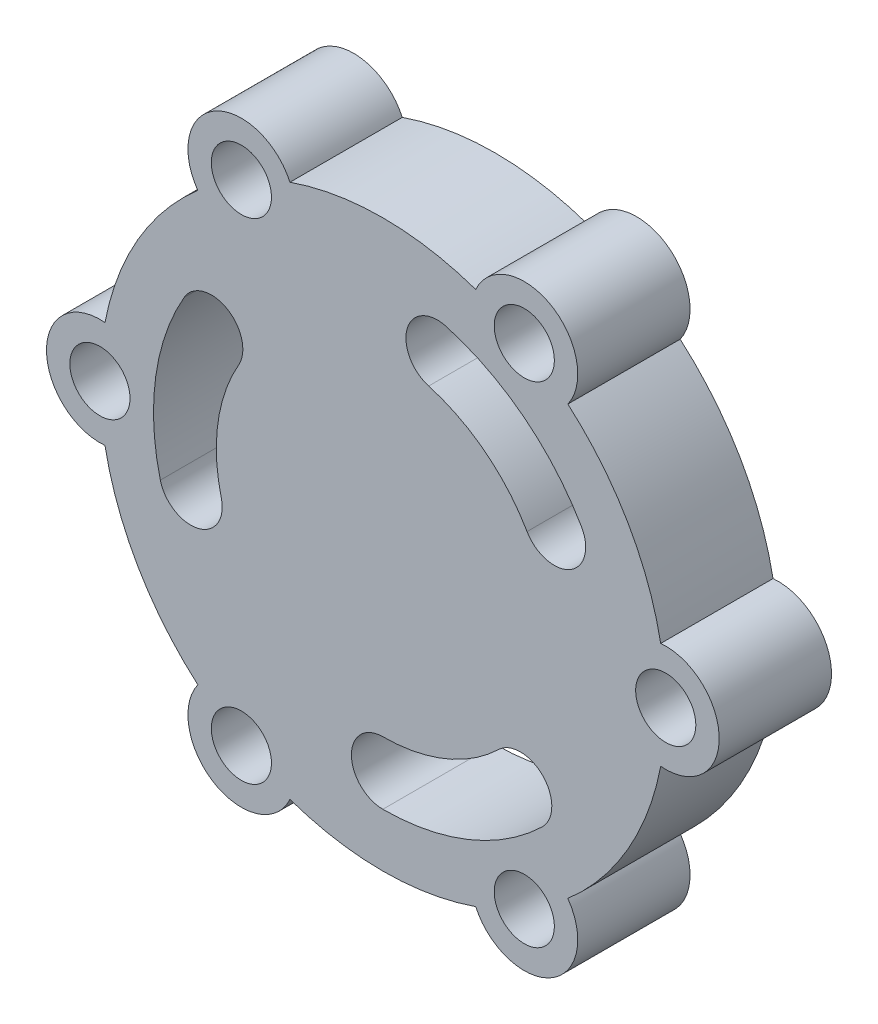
ISO-10303-21;
HEADER;
FILE_DESCRIPTION(('STEP AP214'),'2;1');
FILE_NAME('part.step','',(''),(''),'','','');
FILE_SCHEMA(('AUTOMOTIVE_DESIGN { 1 0 10303 214 1 1 1 1 }'));
ENDSEC;
DATA;
#1=APPLICATION_CONTEXT('core data for automotive mechanical design processes');
#2=APPLICATION_PROTOCOL_DEFINITION('international standard','automotive_design',2000,#1);
#3=PRODUCT_CONTEXT('',#1,'mechanical');
#4=PRODUCT('Part','Part','',(#3));
#5=PRODUCT_RELATED_PRODUCT_CATEGORY('part','',(#4));
#6=PRODUCT_DEFINITION_FORMATION('','',#4);
#7=PRODUCT_DEFINITION_CONTEXT('part definition',#1,'design');
#8=PRODUCT_DEFINITION('design','',#6,#7);
#9=PRODUCT_DEFINITION_SHAPE('','',#8);
#10=(LENGTH_UNIT() NAMED_UNIT(*) SI_UNIT(.MILLI.,.METRE.));
#11=(NAMED_UNIT(*) PLANE_ANGLE_UNIT() SI_UNIT($,.RADIAN.));
#12=(NAMED_UNIT(*) SI_UNIT($,.STERADIAN.) SOLID_ANGLE_UNIT());
#13=UNCERTAINTY_MEASURE_WITH_UNIT(LENGTH_MEASURE(1.E-05),#10,'distance_accuracy_value','');
#14=(GEOMETRIC_REPRESENTATION_CONTEXT(3) GLOBAL_UNCERTAINTY_ASSIGNED_CONTEXT((#13)) GLOBAL_UNIT_ASSIGNED_CONTEXT((#10,
#11,#12)) REPRESENTATION_CONTEXT('',''));
#15=CARTESIAN_POINT('',(0.,0.,0.));
#16=DIRECTION('',(0.,0.,1.));
#17=DIRECTION('',(1.,0.,0.));
#18=AXIS2_PLACEMENT_3D('',#15,#16,#17);
#19=CARTESIAN_POINT('',(25.1872205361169,0.,20.));
#20=DIRECTION('',(0.,0.,1.));
#21=DIRECTION('',(1.,0.,0.));
#22=AXIS2_PLACEMENT_3D('',#19,#20,#21);
#23=PLANE('',#22);
#24=CARTESIAN_POINT('',(-25.1872205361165,43.6255456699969,20.));
#25=DIRECTION('',(0.,0.,1.));
#26=DIRECTION('',(1.,0.,0.));
#27=AXIS2_PLACEMENT_3D('',#24,#25,#26);
#28=CIRCLE('',#27,5.35446502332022);
#29=CARTESIAN_POINT('',(-19.8327555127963,43.6255456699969,20.));
#30=VERTEX_POINT('',#29);
#31=EDGE_CURVE('E737',#30,#30,#28,.T.);
#32=ORIENTED_EDGE('',*,*,#31,.F.);
#33=EDGE_LOOP('',(#32));
#34=FACE_BOUND('',#33,.T.);
#35=CARTESIAN_POINT('',(-25.1872205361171,-43.6255456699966,20.));
#36=DIRECTION('',(0.,0.,1.));
#37=DIRECTION('',(1.,0.,0.));
#38=AXIS2_PLACEMENT_3D('',#35,#36,#37);
#39=CIRCLE('',#38,5.35446502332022);
#40=CARTESIAN_POINT('',(-19.8327555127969,-43.6255456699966,20.));
#41=VERTEX_POINT('',#40);
#42=EDGE_CURVE('E749',#41,#41,#39,.T.);
#43=ORIENTED_EDGE('',*,*,#42,.F.);
#44=EDGE_LOOP('',(#43));
#45=FACE_BOUND('',#44,.T.);
#46=CARTESIAN_POINT('',(50.3744410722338,0.,20.));
#47=DIRECTION('',(0.,0.,1.));
#48=DIRECTION('',(1.,0.,0.));
#49=AXIS2_PLACEMENT_3D('',#46,#47,#48);
#50=CIRCLE('',#49,5.35446502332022);
#51=CARTESIAN_POINT('',(55.728906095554,0.,20.));
#52=VERTEX_POINT('',#51);
#53=EDGE_CURVE('E223',#52,#52,#50,.T.);
#54=ORIENTED_EDGE('',*,*,#53,.F.);
#55=EDGE_LOOP('',(#54));
#56=FACE_BOUND('',#55,.T.);
#57=CARTESIAN_POINT('',(50.3744410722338,0.,20.));
#58=DIRECTION('',(0.,0.,1.));
#59=DIRECTION('',(1.,0.,0.));
#60=AXIS2_PLACEMENT_3D('',#57,#58,#59);
#61=CIRCLE('',#60,9.51422655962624);
#62=CARTESIAN_POINT('',(49.4759645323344,-9.47170770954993,20.));
#63=VERTEX_POINT('',#62);
#64=CARTESIAN_POINT('',(49.4759645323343,9.47170770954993,20.));
#65=VERTEX_POINT('',#64);
#66=EDGE_CURVE('E295',#63,#65,#61,.T.);
#67=ORIENTED_EDGE('',*,*,#66,.T.);
#68=CARTESIAN_POINT('',(0.,0.,20.));
#69=DIRECTION('',(0.,0.,1.));
#70=DIRECTION('',(1.,0.,0.));
#71=AXIS2_PLACEMENT_3D('',#68,#69,#70);
#72=CIRCLE('',#71,50.3744410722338);
#73=CARTESIAN_POINT('',(32.9407217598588,38.1115883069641,20.));
#74=VERTEX_POINT('',#73);
#75=EDGE_CURVE('E298',#65,#74,#72,.T.);
#76=ORIENTED_EDGE('',*,*,#75,.T.);
#77=CARTESIAN_POINT('',(25.1872205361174,43.6255456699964,20.));
#78=DIRECTION('',(0.,0.,1.));
#79=DIRECTION('',(1.,0.,0.));
#80=AXIS2_PLACEMENT_3D('',#77,#78,#79);
#81=CIRCLE('',#80,9.51422655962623);
#82=CARTESIAN_POINT('',(16.5352427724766,47.5832960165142,20.));
#83=VERTEX_POINT('',#82);
#84=EDGE_CURVE('E301',#74,#83,#81,.T.);
#85=ORIENTED_EDGE('',*,*,#84,.T.);
#86=CARTESIAN_POINT('',(0.,0.,20.));
#87=DIRECTION('',(0.,0.,1.));
#88=DIRECTION('',(1.,0.,0.));
#89=AXIS2_PLACEMENT_3D('',#86,#87,#88);
#90=CIRCLE('',#89,50.3744410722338);
#91=CARTESIAN_POINT('',(-16.5352427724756,47.5832960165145,20.));
#92=VERTEX_POINT('',#91);
#93=EDGE_CURVE('E303',#83,#92,#90,.T.);
#94=ORIENTED_EDGE('',*,*,#93,.T.);
#95=CARTESIAN_POINT('',(-25.1872205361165,43.6255456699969,20.));
#96=DIRECTION('',(0.,0.,1.));
#97=DIRECTION('',(1.,0.,0.));
#98=AXIS2_PLACEMENT_3D('',#95,#96,#97);
#99=CIRCLE('',#98,9.51422655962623);
#100=CARTESIAN_POINT('',(-32.940721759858,38.1115883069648,20.));
#101=VERTEX_POINT('',#100);
#102=EDGE_CURVE('E305',#92,#101,#99,.T.);
#103=ORIENTED_EDGE('',*,*,#102,.T.);
#104=CARTESIAN_POINT('',(0.,0.,20.));
#105=DIRECTION('',(0.,0.,1.));
#106=DIRECTION('',(1.,0.,0.));
#107=AXIS2_PLACEMENT_3D('',#104,#105,#106);
#108=CIRCLE('',#107,50.3744410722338);
#109=CARTESIAN_POINT('',(-49.4759645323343,9.47170770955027,20.));
#110=VERTEX_POINT('',#109);
#111=EDGE_CURVE('E307',#101,#110,#108,.T.);
#112=ORIENTED_EDGE('',*,*,#111,.T.);
#113=CARTESIAN_POINT('',(-50.3744410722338,3.51762841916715E-13,20.));
#114=DIRECTION('',(0.,0.,1.));
#115=DIRECTION('',(1.,0.,0.));
#116=AXIS2_PLACEMENT_3D('',#113,#114,#115);
#117=CIRCLE('',#116,9.51422655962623);
#118=CARTESIAN_POINT('',(-49.4759645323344,-9.47170770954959,20.));
#119=VERTEX_POINT('',#118);
#120=EDGE_CURVE('E309',#110,#119,#117,.T.);
#121=ORIENTED_EDGE('',*,*,#120,.T.);
#122=CARTESIAN_POINT('',(0.,0.,20.));
#123=DIRECTION('',(0.,0.,1.));
#124=DIRECTION('',(1.,0.,0.));
#125=AXIS2_PLACEMENT_3D('',#122,#123,#124);
#126=CIRCLE('',#125,50.3744410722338);
#127=CARTESIAN_POINT('',(-32.9407217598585,-38.1115883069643,20.));
#128=VERTEX_POINT('',#127);
#129=EDGE_CURVE('E311',#119,#128,#126,.T.);
#130=ORIENTED_EDGE('',*,*,#129,.T.);
#131=CARTESIAN_POINT('',(-25.1872205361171,-43.6255456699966,20.));
#132=DIRECTION('',(0.,0.,1.));
#133=DIRECTION('',(1.,0.,0.));
#134=AXIS2_PLACEMENT_3D('',#131,#132,#133);
#135=CIRCLE('',#134,9.51422655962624);
#136=CARTESIAN_POINT('',(-16.5352427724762,-47.5832960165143,20.));
#137=VERTEX_POINT('',#136);
#138=EDGE_CURVE('E313',#128,#137,#135,.T.);
#139=ORIENTED_EDGE('',*,*,#138,.T.);
#140=CARTESIAN_POINT('',(0.,0.,20.));
#141=DIRECTION('',(0.,0.,1.));
#142=DIRECTION('',(1.,0.,0.));
#143=AXIS2_PLACEMENT_3D('',#140,#141,#142);
#144=CIRCLE('',#143,50.3744410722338);
#145=CARTESIAN_POINT('',(16.5352427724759,-47.5832960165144,20.));
#146=VERTEX_POINT('',#145);
#147=EDGE_CURVE('E315',#137,#146,#144,.T.);
#148=ORIENTED_EDGE('',*,*,#147,.T.);
#149=CARTESIAN_POINT('',(25.1872205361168,-43.6255456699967,20.));
#150=DIRECTION('',(0.,0.,1.));
#151=DIRECTION('',(1.,0.,0.));
#152=AXIS2_PLACEMENT_3D('',#149,#150,#151);
#153=CIRCLE('',#152,9.51422655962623);
#154=CARTESIAN_POINT('',(32.9407217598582,-38.1115883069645,20.));
#155=VERTEX_POINT('',#154);
#156=EDGE_CURVE('E317',#146,#155,#153,.T.);
#157=ORIENTED_EDGE('',*,*,#156,.T.);
#158=CARTESIAN_POINT('',(0.,0.,20.));
#159=DIRECTION('',(0.,0.,1.));
#160=DIRECTION('',(1.,0.,0.));
#161=AXIS2_PLACEMENT_3D('',#158,#159,#160);
#162=CIRCLE('',#161,50.3744410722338);
#163=EDGE_CURVE('E319',#155,#63,#162,.T.);
#164=ORIENTED_EDGE('',*,*,#163,.T.);
#165=EDGE_LOOP('',(#67,#76,#85,#94,#103,#112,#121,#130,#139,#148,#157,#164));
#166=FACE_BOUND('',#165,.T.);
#167=CARTESIAN_POINT('',(7.25114412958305E-13,-1.26287869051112E-12,20.));
#168=DIRECTION('',(0.,0.,1.));
#169=DIRECTION('',(1.,0.,0.));
#170=AXIS2_PLACEMENT_3D('',#167,#168,#169);
#171=CIRCLE('',#170,40.8381265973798);
#172=CARTESIAN_POINT('',(35.3668550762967,20.4190632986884,20.));
#173=VERTEX_POINT('',#172);
#174=CARTESIAN_POINT('',(11.2406439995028,39.2606737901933,20.));
#175=VERTEX_POINT('',#174);
#176=EDGE_CURVE('E266',#173,#175,#171,.T.);
#177=ORIENTED_EDGE('',*,*,#176,.F.);
#178=CARTESIAN_POINT('',(30.5221471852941,17.621969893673,20.));
#179=DIRECTION('',(0.,0.,1.));
#180=DIRECTION('',(1.,0.,0.));
#181=AXIS2_PLACEMENT_3D('',#178,#179,#180);
#182=CIRCLE('',#181,5.59418681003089);
#183=CARTESIAN_POINT('',(25.6774392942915,14.8248764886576,20.));
#184=VERTEX_POINT('',#183);
#185=EDGE_CURVE('E264',#184,#173,#182,.T.);
#186=ORIENTED_EDGE('',*,*,#185,.F.);
#187=CARTESIAN_POINT('',(7.25114412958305E-13,-1.26287869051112E-12,20.));
#188=DIRECTION('',(0.,0.,-1.));
#189=DIRECTION('',(1.,0.,0.));
#190=AXIS2_PLACEMENT_3D('',#187,#188,#189);
#191=CIRCLE('',#190,29.649752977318);
#192=CARTESIAN_POINT('',(8.16105795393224,28.5044730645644,20.));
#193=VERTEX_POINT('',#192);
#194=EDGE_CURVE('E272',#193,#184,#191,.T.);
#195=ORIENTED_EDGE('',*,*,#194,.F.);
#196=CARTESIAN_POINT('',(9.70085097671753,33.8825734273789,20.));
#197=DIRECTION('',(0.,0.,1.));
#198=DIRECTION('',(1.,0.,0.));
#199=AXIS2_PLACEMENT_3D('',#196,#197,#198);
#200=CIRCLE('',#199,5.59418681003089);
#201=EDGE_CURVE('E269',#175,#193,#200,.T.);
#202=ORIENTED_EDGE('',*,*,#201,.F.);
#203=EDGE_LOOP('',(#177,#186,#195,#202));
#204=FACE_BOUND('',#203,.T.);
#205=CARTESIAN_POINT('',(7.25114412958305E-13,-1.26287869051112E-12,20.));
#206=DIRECTION('',(0.,0.,1.));
#207=DIRECTION('',(1.,0.,0.));
#208=AXIS2_PLACEMENT_3D('',#205,#206,#207);
#209=CIRCLE('',#208,40.8381265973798);
#210=CARTESIAN_POINT('',(4.27440228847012E-13,-40.838126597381,20.));
#211=VERTEX_POINT('',#210);
#212=CARTESIAN_POINT('',(28.3804188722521,-29.3650201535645,20.));
#213=VERTEX_POINT('',#212);
#214=EDGE_CURVE('E235',#211,#213,#209,.T.);
#215=ORIENTED_EDGE('',*,*,#214,.F.);
#216=CARTESIAN_POINT('',(4.83737870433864E-13,-35.2439397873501,20.));
#217=DIRECTION('',(0.,0.,1.));
#218=DIRECTION('',(1.,0.,0.));
#219=AXIS2_PLACEMENT_3D('',#216,#217,#218);
#220=CIRCLE('',#219,5.59418681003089);
#221=CARTESIAN_POINT('',(5.08993675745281E-13,-29.6497529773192,20.));
#222=VERTEX_POINT('',#221);
#223=EDGE_CURVE('E233',#222,#211,#220,.T.);
#224=ORIENTED_EDGE('',*,*,#223,.F.);
#225=CARTESIAN_POINT('',(7.25114412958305E-13,-1.26287869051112E-12,20.));
#226=DIRECTION('',(0.,0.,-1.));
#227=DIRECTION('',(1.,0.,0.));
#228=AXIS2_PLACEMENT_3D('',#225,#226,#227);
#229=CIRCLE('',#228,29.649752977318);
#230=CARTESIAN_POINT('',(20.6050688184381,-21.3199200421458,20.));
#231=VERTEX_POINT('',#230);
#232=EDGE_CURVE('E241',#231,#222,#229,.T.);
#233=ORIENTED_EDGE('',*,*,#232,.F.);
#234=CARTESIAN_POINT('',(24.4927438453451,-25.3424700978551,20.));
#235=DIRECTION('',(0.,0.,1.));
#236=DIRECTION('',(1.,0.,0.));
#237=AXIS2_PLACEMENT_3D('',#234,#235,#236);
#238=CIRCLE('',#237,5.59418681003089);
#239=EDGE_CURVE('E238',#213,#231,#238,.T.);
#240=ORIENTED_EDGE('',*,*,#239,.F.);
#241=EDGE_LOOP('',(#215,#224,#233,#240));
#242=FACE_BOUND('',#241,.T.);
#243=CARTESIAN_POINT('',(7.25114412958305E-13,-1.26287869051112E-12,20.));
#244=DIRECTION('',(0.,0.,1.));
#245=DIRECTION('',(1.,0.,0.));
#246=AXIS2_PLACEMENT_3D('',#243,#244,#245);
#247=CIRCLE('',#246,40.8381265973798);
#248=CARTESIAN_POINT('',(-35.366855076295,20.4190632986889,20.));
#249=VERTEX_POINT('',#248);
#250=CARTESIAN_POINT('',(-39.6210628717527,-9.89565363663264,20.));
#251=VERTEX_POINT('',#250);
#252=EDGE_CURVE('E202',#249,#251,#247,.T.);
#253=ORIENTED_EDGE('',*,*,#252,.F.);
#254=CARTESIAN_POINT('',(-30.5221471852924,17.6219698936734,20.));
#255=DIRECTION('',(0.,0.,1.));
#256=DIRECTION('',(1.,0.,0.));
#257=AXIS2_PLACEMENT_3D('',#254,#255,#256);
#258=CIRCLE('',#257,5.59418681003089);
#259=CARTESIAN_POINT('',(-25.6774392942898,14.8248764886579,20.));
#260=VERTEX_POINT('',#259);
#261=EDGE_CURVE('E194',#260,#249,#258,.T.);
#262=ORIENTED_EDGE('',*,*,#261,.F.);
#263=CARTESIAN_POINT('',(7.25114412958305E-13,-1.26287869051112E-12,20.));
#264=DIRECTION('',(0.,0.,-1.));
#265=DIRECTION('',(1.,0.,0.));
#266=AXIS2_PLACEMENT_3D('',#263,#264,#265);
#267=CIRCLE('',#266,29.649752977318);
#268=CARTESIAN_POINT('',(-28.7661267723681,-7.18455302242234,20.));
#269=VERTEX_POINT('',#268);
#270=EDGE_CURVE('E217',#269,#260,#267,.T.);
#271=ORIENTED_EDGE('',*,*,#270,.F.);
#272=CARTESIAN_POINT('',(-34.1935948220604,-8.5401033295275,20.));
#273=DIRECTION('',(0.,0.,1.));
#274=DIRECTION('',(1.,0.,0.));
#275=AXIS2_PLACEMENT_3D('',#272,#273,#274);
#276=CIRCLE('',#275,5.59418681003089);
#277=EDGE_CURVE('E215',#251,#269,#276,.T.);
#278=ORIENTED_EDGE('',*,*,#277,.F.);
#279=EDGE_LOOP('',(#253,#262,#271,#278));
#280=FACE_BOUND('',#279,.T.);
#281=CARTESIAN_POINT('',(25.1872205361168,-43.6255456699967,20.));
#282=DIRECTION('',(0.,0.,1.));
#283=DIRECTION('',(1.,0.,0.));
#284=AXIS2_PLACEMENT_3D('',#281,#282,#283);
#285=CIRCLE('',#284,5.35446502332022);
#286=CARTESIAN_POINT('',(30.541685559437,-43.6255456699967,20.));
#287=VERTEX_POINT('',#286);
#288=EDGE_CURVE('E755',#287,#287,#285,.T.);
#289=ORIENTED_EDGE('',*,*,#288,.F.);
#290=EDGE_LOOP('',(#289));
#291=FACE_BOUND('',#290,.T.);
#292=CARTESIAN_POINT('',(-50.3744410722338,3.51762841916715E-13,20.));
#293=DIRECTION('',(0.,0.,1.));
#294=DIRECTION('',(1.,0.,0.));
#295=AXIS2_PLACEMENT_3D('',#292,#293,#294);
#296=CIRCLE('',#295,5.35446502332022);
#297=CARTESIAN_POINT('',(-45.0199760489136,3.51762841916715E-13,20.));
#298=VERTEX_POINT('',#297);
#299=EDGE_CURVE('E743',#298,#298,#296,.T.);
#300=ORIENTED_EDGE('',*,*,#299,.F.);
#301=EDGE_LOOP('',(#300));
#302=FACE_BOUND('',#301,.T.);
#303=CARTESIAN_POINT('',(25.1872205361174,43.6255456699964,20.));
#304=DIRECTION('',(0.,0.,1.));
#305=DIRECTION('',(1.,0.,0.));
#306=AXIS2_PLACEMENT_3D('',#303,#304,#305);
#307=CIRCLE('',#306,5.35446502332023);
#308=CARTESIAN_POINT('',(30.5416855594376,43.6255456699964,20.));
#309=VERTEX_POINT('',#308);
#310=EDGE_CURVE('E728',#309,#309,#307,.T.);
#311=ORIENTED_EDGE('',*,*,#310,.F.);
#312=EDGE_LOOP('',(#311));
#313=FACE_BOUND('',#312,.T.);
#314=ADVANCED_FACE('F33',(#34,#45,#56,#166,#204,#242,#280,#291,#302,#313),#23,.T.);
#315=CARTESIAN_POINT('',(25.1872205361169,0.,0.));
#316=DIRECTION('',(0.,0.,1.));
#317=DIRECTION('',(1.,0.,0.));
#318=AXIS2_PLACEMENT_3D('',#315,#316,#317);
#319=PLANE('',#318);
#320=CARTESIAN_POINT('',(4.83737870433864E-13,-35.2439397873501,0.));
#321=DIRECTION('',(0.,0.,1.));
#322=DIRECTION('',(1.,0.,0.));
#323=AXIS2_PLACEMENT_3D('',#320,#321,#322);
#324=CIRCLE('',#323,5.59418681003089);
#325=CARTESIAN_POINT('',(5.08993675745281E-13,-29.6497529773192,0.));
#326=VERTEX_POINT('',#325);
#327=CARTESIAN_POINT('',(4.27440228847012E-13,-40.838126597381,0.));
#328=VERTEX_POINT('',#327);
#329=EDGE_CURVE('E210',#326,#328,#324,.T.);
#330=ORIENTED_EDGE('',*,*,#329,.T.);
#331=CARTESIAN_POINT('',(7.25114412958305E-13,-1.26287869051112E-12,0.));
#332=DIRECTION('',(0.,0.,1.));
#333=DIRECTION('',(1.,0.,0.));
#334=AXIS2_PLACEMENT_3D('',#331,#332,#333);
#335=CIRCLE('',#334,40.8381265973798);
#336=CARTESIAN_POINT('',(28.3804188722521,-29.3650201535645,0.));
#337=VERTEX_POINT('',#336);
#338=EDGE_CURVE('E246',#328,#337,#335,.T.);
#339=ORIENTED_EDGE('',*,*,#338,.T.);
#340=CARTESIAN_POINT('',(24.4927438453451,-25.3424700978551,0.));
#341=DIRECTION('',(0.,0.,1.));
#342=DIRECTION('',(1.,0.,0.));
#343=AXIS2_PLACEMENT_3D('',#340,#341,#342);
#344=CIRCLE('',#343,5.59418681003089);
#345=CARTESIAN_POINT('',(20.6050688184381,-21.3199200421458,0.));
#346=VERTEX_POINT('',#345);
#347=EDGE_CURVE('E249',#337,#346,#344,.T.);
#348=ORIENTED_EDGE('',*,*,#347,.T.);
#349=CARTESIAN_POINT('',(7.25114412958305E-13,-1.26287869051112E-12,0.));
#350=DIRECTION('',(0.,0.,-1.));
#351=DIRECTION('',(1.,0.,0.));
#352=AXIS2_PLACEMENT_3D('',#349,#350,#351);
#353=CIRCLE('',#352,29.649752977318);
#354=EDGE_CURVE('E236',#346,#326,#353,.T.);
#355=ORIENTED_EDGE('',*,*,#354,.T.);
#356=EDGE_LOOP('',(#330,#339,#348,#355));
#357=FACE_BOUND('',#356,.T.);
#358=CARTESIAN_POINT('',(50.3744410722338,0.,0.));
#359=DIRECTION('',(0.,0.,1.));
#360=DIRECTION('',(1.,0.,0.));
#361=AXIS2_PLACEMENT_3D('',#358,#359,#360);
#362=CIRCLE('',#361,9.51422655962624);
#363=CARTESIAN_POINT('',(49.4759645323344,-9.47170770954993,0.));
#364=VERTEX_POINT('',#363);
#365=CARTESIAN_POINT('',(49.4759645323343,9.47170770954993,0.));
#366=VERTEX_POINT('',#365);
#367=EDGE_CURVE('E294',#364,#366,#362,.T.);
#368=ORIENTED_EDGE('',*,*,#367,.F.);
#369=CARTESIAN_POINT('',(0.,0.,0.));
#370=DIRECTION('',(0.,0.,1.));
#371=DIRECTION('',(1.,0.,0.));
#372=AXIS2_PLACEMENT_3D('',#369,#370,#371);
#373=CIRCLE('',#372,50.3744410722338);
#374=CARTESIAN_POINT('',(32.9407217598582,-38.1115883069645,0.));
#375=VERTEX_POINT('',#374);
#376=EDGE_CURVE('E299',#375,#364,#373,.T.);
#377=ORIENTED_EDGE('',*,*,#376,.F.);
#378=CARTESIAN_POINT('',(25.1872205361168,-43.6255456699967,0.));
#379=DIRECTION('',(0.,0.,1.));
#380=DIRECTION('',(1.,0.,0.));
#381=AXIS2_PLACEMENT_3D('',#378,#379,#380);
#382=CIRCLE('',#381,9.51422655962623);
#383=CARTESIAN_POINT('',(16.5352427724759,-47.5832960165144,0.));
#384=VERTEX_POINT('',#383);
#385=EDGE_CURVE('E342',#384,#375,#382,.T.);
#386=ORIENTED_EDGE('',*,*,#385,.F.);
#387=CARTESIAN_POINT('',(0.,0.,0.));
#388=DIRECTION('',(0.,0.,1.));
#389=DIRECTION('',(1.,0.,0.));
#390=AXIS2_PLACEMENT_3D('',#387,#388,#389);
#391=CIRCLE('',#390,50.3744410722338);
#392=CARTESIAN_POINT('',(-16.5352427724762,-47.5832960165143,0.));
#393=VERTEX_POINT('',#392);
#394=EDGE_CURVE('E340',#393,#384,#391,.T.);
#395=ORIENTED_EDGE('',*,*,#394,.F.);
#396=CARTESIAN_POINT('',(-25.1872205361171,-43.6255456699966,0.));
#397=DIRECTION('',(0.,0.,1.));
#398=DIRECTION('',(1.,0.,0.));
#399=AXIS2_PLACEMENT_3D('',#396,#397,#398);
#400=CIRCLE('',#399,9.51422655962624);
#401=CARTESIAN_POINT('',(-32.9407217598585,-38.1115883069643,0.));
#402=VERTEX_POINT('',#401);
#403=EDGE_CURVE('E338',#402,#393,#400,.T.);
#404=ORIENTED_EDGE('',*,*,#403,.F.);
#405=CARTESIAN_POINT('',(0.,0.,0.));
#406=DIRECTION('',(0.,0.,1.));
#407=DIRECTION('',(1.,0.,0.));
#408=AXIS2_PLACEMENT_3D('',#405,#406,#407);
#409=CIRCLE('',#408,50.3744410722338);
#410=CARTESIAN_POINT('',(-49.4759645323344,-9.47170770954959,0.));
#411=VERTEX_POINT('',#410);
#412=EDGE_CURVE('E336',#411,#402,#409,.T.);
#413=ORIENTED_EDGE('',*,*,#412,.F.);
#414=CARTESIAN_POINT('',(-50.3744410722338,3.51762841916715E-13,0.));
#415=DIRECTION('',(0.,0.,1.));
#416=DIRECTION('',(1.,0.,0.));
#417=AXIS2_PLACEMENT_3D('',#414,#415,#416);
#418=CIRCLE('',#417,9.51422655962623);
#419=CARTESIAN_POINT('',(-49.4759645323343,9.47170770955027,0.));
#420=VERTEX_POINT('',#419);
#421=EDGE_CURVE('E334',#420,#411,#418,.T.);
#422=ORIENTED_EDGE('',*,*,#421,.F.);
#423=CARTESIAN_POINT('',(0.,0.,0.));
#424=DIRECTION('',(0.,0.,1.));
#425=DIRECTION('',(1.,0.,0.));
#426=AXIS2_PLACEMENT_3D('',#423,#424,#425);
#427=CIRCLE('',#426,50.3744410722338);
#428=CARTESIAN_POINT('',(-32.940721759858,38.1115883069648,0.));
#429=VERTEX_POINT('',#428);
#430=EDGE_CURVE('E332',#429,#420,#427,.T.);
#431=ORIENTED_EDGE('',*,*,#430,.F.);
#432=CARTESIAN_POINT('',(-25.1872205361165,43.6255456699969,0.));
#433=DIRECTION('',(0.,0.,1.));
#434=DIRECTION('',(1.,0.,0.));
#435=AXIS2_PLACEMENT_3D('',#432,#433,#434);
#436=CIRCLE('',#435,9.51422655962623);
#437=CARTESIAN_POINT('',(-16.5352427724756,47.5832960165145,0.));
#438=VERTEX_POINT('',#437);
#439=EDGE_CURVE('E330',#438,#429,#436,.T.);
#440=ORIENTED_EDGE('',*,*,#439,.F.);
#441=CARTESIAN_POINT('',(0.,0.,0.));
#442=DIRECTION('',(0.,0.,1.));
#443=DIRECTION('',(1.,0.,0.));
#444=AXIS2_PLACEMENT_3D('',#441,#442,#443);
#445=CIRCLE('',#444,50.3744410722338);
#446=CARTESIAN_POINT('',(16.5352427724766,47.5832960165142,0.));
#447=VERTEX_POINT('',#446);
#448=EDGE_CURVE('E328',#447,#438,#445,.T.);
#449=ORIENTED_EDGE('',*,*,#448,.F.);
#450=CARTESIAN_POINT('',(25.1872205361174,43.6255456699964,0.));
#451=DIRECTION('',(0.,0.,1.));
#452=DIRECTION('',(1.,0.,0.));
#453=AXIS2_PLACEMENT_3D('',#450,#451,#452);
#454=CIRCLE('',#453,9.51422655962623);
#455=CARTESIAN_POINT('',(32.9407217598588,38.1115883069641,0.));
#456=VERTEX_POINT('',#455);
#457=EDGE_CURVE('E326',#456,#447,#454,.T.);
#458=ORIENTED_EDGE('',*,*,#457,.F.);
#459=CARTESIAN_POINT('',(0.,0.,0.));
#460=DIRECTION('',(0.,0.,1.));
#461=DIRECTION('',(1.,0.,0.));
#462=AXIS2_PLACEMENT_3D('',#459,#460,#461);
#463=CIRCLE('',#462,50.3744410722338);
#464=EDGE_CURVE('E324',#366,#456,#463,.T.);
#465=ORIENTED_EDGE('',*,*,#464,.F.);
#466=EDGE_LOOP('',(#368,#377,#386,#395,#404,#413,#422,#431,#440,#449,#458,#465));
#467=FACE_BOUND('',#466,.T.);
#468=CARTESIAN_POINT('',(30.5221471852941,17.621969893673,0.));
#469=DIRECTION('',(0.,0.,1.));
#470=DIRECTION('',(1.,0.,0.));
#471=AXIS2_PLACEMENT_3D('',#468,#469,#470);
#472=CIRCLE('',#471,5.59418681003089);
#473=CARTESIAN_POINT('',(25.6774392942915,14.8248764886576,0.));
#474=VERTEX_POINT('',#473);
#475=CARTESIAN_POINT('',(35.3668550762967,20.4190632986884,0.));
#476=VERTEX_POINT('',#475);
#477=EDGE_CURVE('E263',#474,#476,#472,.T.);
#478=ORIENTED_EDGE('',*,*,#477,.T.);
#479=CARTESIAN_POINT('',(7.25114412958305E-13,-1.26287869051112E-12,0.));
#480=DIRECTION('',(0.,0.,1.));
#481=DIRECTION('',(1.,0.,0.));
#482=AXIS2_PLACEMENT_3D('',#479,#480,#481);
#483=CIRCLE('',#482,40.8381265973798);
#484=CARTESIAN_POINT('',(11.2406439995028,39.2606737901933,0.));
#485=VERTEX_POINT('',#484);
#486=EDGE_CURVE('E277',#476,#485,#483,.T.);
#487=ORIENTED_EDGE('',*,*,#486,.T.);
#488=CARTESIAN_POINT('',(9.70085097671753,33.8825734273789,0.));
#489=DIRECTION('',(0.,0.,1.));
#490=DIRECTION('',(1.,0.,0.));
#491=AXIS2_PLACEMENT_3D('',#488,#489,#490);
#492=CIRCLE('',#491,5.59418681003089);
#493=CARTESIAN_POINT('',(8.16105795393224,28.5044730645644,0.));
#494=VERTEX_POINT('',#493);
#495=EDGE_CURVE('E280',#485,#494,#492,.T.);
#496=ORIENTED_EDGE('',*,*,#495,.T.);
#497=CARTESIAN_POINT('',(7.25114412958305E-13,-1.26287869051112E-12,0.));
#498=DIRECTION('',(0.,0.,-1.));
#499=DIRECTION('',(1.,0.,0.));
#500=AXIS2_PLACEMENT_3D('',#497,#498,#499);
#501=CIRCLE('',#500,29.649752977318);
#502=EDGE_CURVE('E267',#494,#474,#501,.T.);
#503=ORIENTED_EDGE('',*,*,#502,.T.);
#504=EDGE_LOOP('',(#478,#487,#496,#503));
#505=FACE_BOUND('',#504,.T.);
#506=CARTESIAN_POINT('',(-30.5221471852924,17.6219698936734,0.));
#507=DIRECTION('',(0.,0.,1.));
#508=DIRECTION('',(1.,0.,0.));
#509=AXIS2_PLACEMENT_3D('',#506,#507,#508);
#510=CIRCLE('',#509,5.59418681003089);
#511=CARTESIAN_POINT('',(-25.6774392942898,14.8248764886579,0.));
#512=VERTEX_POINT('',#511);
#513=CARTESIAN_POINT('',(-35.366855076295,20.4190632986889,0.));
#514=VERTEX_POINT('',#513);
#515=EDGE_CURVE('E56',#512,#514,#510,.T.);
#516=ORIENTED_EDGE('',*,*,#515,.T.);
#517=CARTESIAN_POINT('',(7.25114412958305E-13,-1.26287869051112E-12,0.));
#518=DIRECTION('',(0.,0.,1.));
#519=DIRECTION('',(1.,0.,0.));
#520=AXIS2_PLACEMENT_3D('',#517,#518,#519);
#521=CIRCLE('',#520,40.8381265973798);
#522=CARTESIAN_POINT('',(-39.6210628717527,-9.89565363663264,0.));
#523=VERTEX_POINT('',#522);
#524=EDGE_CURVE('E209',#514,#523,#521,.T.);
#525=ORIENTED_EDGE('',*,*,#524,.T.);
#526=CARTESIAN_POINT('',(-34.1935948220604,-8.5401033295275,0.));
#527=DIRECTION('',(0.,0.,1.));
#528=DIRECTION('',(1.,0.,0.));
#529=AXIS2_PLACEMENT_3D('',#526,#527,#528);
#530=CIRCLE('',#529,5.59418681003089);
#531=CARTESIAN_POINT('',(-28.7661267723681,-7.18455302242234,0.));
#532=VERTEX_POINT('',#531);
#533=EDGE_CURVE('E225',#523,#532,#530,.T.);
#534=ORIENTED_EDGE('',*,*,#533,.T.);
#535=CARTESIAN_POINT('',(7.25114412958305E-13,-1.26287869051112E-12,0.));
#536=DIRECTION('',(0.,0.,-1.));
#537=DIRECTION('',(1.,0.,0.));
#538=AXIS2_PLACEMENT_3D('',#535,#536,#537);
#539=CIRCLE('',#538,29.649752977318);
#540=EDGE_CURVE('E203',#532,#512,#539,.T.);
#541=ORIENTED_EDGE('',*,*,#540,.T.);
#542=EDGE_LOOP('',(#516,#525,#534,#541));
#543=FACE_BOUND('',#542,.T.);
#544=CARTESIAN_POINT('',(50.3744410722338,0.,0.));
#545=DIRECTION('',(0.,0.,1.));
#546=DIRECTION('',(1.,0.,0.));
#547=AXIS2_PLACEMENT_3D('',#544,#545,#546);
#548=CIRCLE('',#547,5.35446502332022);
#549=CARTESIAN_POINT('',(55.728906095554,0.,0.));
#550=VERTEX_POINT('',#549);
#551=EDGE_CURVE('E758',#550,#550,#548,.T.);
#552=ORIENTED_EDGE('',*,*,#551,.T.);
#553=EDGE_LOOP('',(#552));
#554=FACE_BOUND('',#553,.T.);
#555=CARTESIAN_POINT('',(25.1872205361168,-43.6255456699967,0.));
#556=DIRECTION('',(0.,0.,1.));
#557=DIRECTION('',(1.,0.,0.));
#558=AXIS2_PLACEMENT_3D('',#555,#556,#557);
#559=CIRCLE('',#558,5.35446502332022);
#560=CARTESIAN_POINT('',(30.541685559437,-43.6255456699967,0.));
#561=VERTEX_POINT('',#560);
#562=EDGE_CURVE('E752',#561,#561,#559,.T.);
#563=ORIENTED_EDGE('',*,*,#562,.T.);
#564=EDGE_LOOP('',(#563));
#565=FACE_BOUND('',#564,.T.);
#566=CARTESIAN_POINT('',(-25.1872205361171,-43.6255456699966,0.));
#567=DIRECTION('',(0.,0.,1.));
#568=DIRECTION('',(1.,0.,0.));
#569=AXIS2_PLACEMENT_3D('',#566,#567,#568);
#570=CIRCLE('',#569,5.35446502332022);
#571=CARTESIAN_POINT('',(-19.8327555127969,-43.6255456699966,0.));
#572=VERTEX_POINT('',#571);
#573=EDGE_CURVE('E746',#572,#572,#570,.T.);
#574=ORIENTED_EDGE('',*,*,#573,.T.);
#575=EDGE_LOOP('',(#574));
#576=FACE_BOUND('',#575,.T.);
#577=CARTESIAN_POINT('',(-50.3744410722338,3.51762841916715E-13,0.));
#578=DIRECTION('',(0.,0.,1.));
#579=DIRECTION('',(1.,0.,0.));
#580=AXIS2_PLACEMENT_3D('',#577,#578,#579);
#581=CIRCLE('',#580,5.35446502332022);
#582=CARTESIAN_POINT('',(-45.0199760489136,3.51762841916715E-13,0.));
#583=VERTEX_POINT('',#582);
#584=EDGE_CURVE('E740',#583,#583,#581,.T.);
#585=ORIENTED_EDGE('',*,*,#584,.T.);
#586=EDGE_LOOP('',(#585));
#587=FACE_BOUND('',#586,.T.);
#588=CARTESIAN_POINT('',(-25.1872205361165,43.6255456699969,0.));
#589=DIRECTION('',(0.,0.,1.));
#590=DIRECTION('',(1.,0.,0.));
#591=AXIS2_PLACEMENT_3D('',#588,#589,#590);
#592=CIRCLE('',#591,5.35446502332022);
#593=CARTESIAN_POINT('',(-19.8327555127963,43.6255456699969,0.));
#594=VERTEX_POINT('',#593);
#595=EDGE_CURVE('E734',#594,#594,#592,.T.);
#596=ORIENTED_EDGE('',*,*,#595,.T.);
#597=EDGE_LOOP('',(#596));
#598=FACE_BOUND('',#597,.T.);
#599=CARTESIAN_POINT('',(25.1872205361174,43.6255456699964,0.));
#600=DIRECTION('',(0.,0.,1.));
#601=DIRECTION('',(1.,0.,0.));
#602=AXIS2_PLACEMENT_3D('',#599,#600,#601);
#603=CIRCLE('',#602,5.35446502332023);
#604=CARTESIAN_POINT('',(30.5416855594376,43.6255456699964,0.));
#605=VERTEX_POINT('',#604);
#606=EDGE_CURVE('E731',#605,#605,#603,.T.);
#607=ORIENTED_EDGE('',*,*,#606,.T.);
#608=EDGE_LOOP('',(#607));
#609=FACE_BOUND('',#608,.T.);
#610=ADVANCED_FACE('F384',(#357,#467,#505,#543,#554,#565,#576,#587,#598,#609),#319,.F.);
#611=CARTESIAN_POINT('',(50.3744410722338,0.,20.));
#612=DIRECTION('',(0.,0.,-1.));
#613=DIRECTION('',(-1.,0.,0.));
#614=AXIS2_PLACEMENT_3D('',#611,#612,#613);
#615=CYLINDRICAL_SURFACE('',#614,9.51422655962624);
#616=ORIENTED_EDGE('',*,*,#367,.T.);
#617=DIRECTION('',(0.,0.,-1.));
#618=VECTOR('',#617,1.);
#619=CARTESIAN_POINT('',(49.4759645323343,9.47170770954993,20.));
#620=LINE('',#619,#618);
#621=EDGE_CURVE('E11',#65,#366,#620,.T.);
#622=ORIENTED_EDGE('',*,*,#621,.F.);
#623=ORIENTED_EDGE('',*,*,#66,.F.);
#624=DIRECTION('',(0.,0.,-1.));
#625=VECTOR('',#624,1.);
#626=CARTESIAN_POINT('',(49.4759645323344,-9.47170770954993,20.));
#627=LINE('',#626,#625);
#628=EDGE_CURVE('E321',#63,#364,#627,.T.);
#629=ORIENTED_EDGE('',*,*,#628,.T.);
#630=EDGE_LOOP('',(#616,#622,#623,#629));
#631=FACE_BOUND('',#630,.T.);
#632=ADVANCED_FACE('F35',(#631),#615,.T.);
#633=CARTESIAN_POINT('',(0.,0.,20.));
#634=DIRECTION('',(0.,0.,-1.));
#635=DIRECTION('',(-1.,0.,0.));
#636=AXIS2_PLACEMENT_3D('',#633,#634,#635);
#637=CYLINDRICAL_SURFACE('',#636,50.3744410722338);
#638=ORIENTED_EDGE('',*,*,#464,.T.);
#639=DIRECTION('',(0.,0.,-1.));
#640=VECTOR('',#639,1.);
#641=CARTESIAN_POINT('',(32.9407217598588,38.1115883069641,20.));
#642=LINE('',#641,#640);
#643=EDGE_CURVE('E41',#74,#456,#642,.T.);
#644=ORIENTED_EDGE('',*,*,#643,.F.);
#645=ORIENTED_EDGE('',*,*,#75,.F.);
#646=ORIENTED_EDGE('',*,*,#621,.T.);
#647=EDGE_LOOP('',(#638,#644,#645,#646));
#648=FACE_BOUND('',#647,.T.);
#649=ADVANCED_FACE('F402',(#648),#637,.T.);
#650=CARTESIAN_POINT('',(25.1872205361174,43.6255456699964,20.));
#651=DIRECTION('',(0.,0.,-1.));
#652=DIRECTION('',(-1.,0.,0.));
#653=AXIS2_PLACEMENT_3D('',#650,#651,#652);
#654=CYLINDRICAL_SURFACE('',#653,9.51422655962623);
#655=ORIENTED_EDGE('',*,*,#457,.T.);
#656=DIRECTION('',(0.,0.,-1.));
#657=VECTOR('',#656,1.);
#658=CARTESIAN_POINT('',(16.5352427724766,47.5832960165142,20.));
#659=LINE('',#658,#657);
#660=EDGE_CURVE('E371',#83,#447,#659,.T.);
#661=ORIENTED_EDGE('',*,*,#660,.F.);
#662=ORIENTED_EDGE('',*,*,#84,.F.);
#663=ORIENTED_EDGE('',*,*,#643,.T.);
#664=EDGE_LOOP('',(#655,#661,#662,#663));
#665=FACE_BOUND('',#664,.T.);
#666=ADVANCED_FACE('F378',(#665),#654,.T.);
#667=CARTESIAN_POINT('',(0.,0.,20.));
#668=DIRECTION('',(0.,0.,-1.));
#669=DIRECTION('',(-1.,0.,0.));
#670=AXIS2_PLACEMENT_3D('',#667,#668,#669);
#671=CYLINDRICAL_SURFACE('',#670,50.3744410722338);
#672=ORIENTED_EDGE('',*,*,#448,.T.);
#673=DIRECTION('',(0.,0.,-1.));
#674=VECTOR('',#673,1.);
#675=CARTESIAN_POINT('',(-16.5352427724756,47.5832960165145,20.));
#676=LINE('',#675,#674);
#677=EDGE_CURVE('E368',#92,#438,#676,.T.);
#678=ORIENTED_EDGE('',*,*,#677,.F.);
#679=ORIENTED_EDGE('',*,*,#93,.F.);
#680=ORIENTED_EDGE('',*,*,#660,.T.);
#681=EDGE_LOOP('',(#672,#678,#679,#680));
#682=FACE_BOUND('',#681,.T.);
#683=ADVANCED_FACE('F390',(#682),#671,.T.);
#684=CARTESIAN_POINT('',(-25.1872205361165,43.6255456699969,20.));
#685=DIRECTION('',(0.,0.,-1.));
#686=DIRECTION('',(-1.,0.,0.));
#687=AXIS2_PLACEMENT_3D('',#684,#685,#686);
#688=CYLINDRICAL_SURFACE('',#687,9.51422655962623);
#689=ORIENTED_EDGE('',*,*,#439,.T.);
#690=DIRECTION('',(0.,0.,-1.));
#691=VECTOR('',#690,1.);
#692=CARTESIAN_POINT('',(-32.940721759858,38.1115883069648,20.));
#693=LINE('',#692,#691);
#694=EDGE_CURVE('E365',#101,#429,#693,.T.);
#695=ORIENTED_EDGE('',*,*,#694,.F.);
#696=ORIENTED_EDGE('',*,*,#102,.F.);
#697=ORIENTED_EDGE('',*,*,#677,.T.);
#698=EDGE_LOOP('',(#689,#695,#696,#697));
#699=FACE_BOUND('',#698,.T.);
#700=ADVANCED_FACE('F394',(#699),#688,.T.);
#701=CARTESIAN_POINT('',(0.,0.,20.));
#702=DIRECTION('',(0.,0.,-1.));
#703=DIRECTION('',(-1.,0.,0.));
#704=AXIS2_PLACEMENT_3D('',#701,#702,#703);
#705=CYLINDRICAL_SURFACE('',#704,50.3744410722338);
#706=ORIENTED_EDGE('',*,*,#430,.T.);
#707=DIRECTION('',(0.,0.,-1.));
#708=VECTOR('',#707,1.);
#709=CARTESIAN_POINT('',(-49.4759645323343,9.47170770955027,20.));
#710=LINE('',#709,#708);
#711=EDGE_CURVE('E362',#110,#420,#710,.T.);
#712=ORIENTED_EDGE('',*,*,#711,.F.);
#713=ORIENTED_EDGE('',*,*,#111,.F.);
#714=ORIENTED_EDGE('',*,*,#694,.T.);
#715=EDGE_LOOP('',(#706,#712,#713,#714));
#716=FACE_BOUND('',#715,.T.);
#717=ADVANCED_FACE('F435',(#716),#705,.T.);
#718=CARTESIAN_POINT('',(-50.3744410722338,3.51762841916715E-13,20.));
#719=DIRECTION('',(0.,0.,-1.));
#720=DIRECTION('',(-1.,0.,0.));
#721=AXIS2_PLACEMENT_3D('',#718,#719,#720);
#722=CYLINDRICAL_SURFACE('',#721,9.51422655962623);
#723=ORIENTED_EDGE('',*,*,#421,.T.);
#724=DIRECTION('',(0.,0.,-1.));
#725=VECTOR('',#724,1.);
#726=CARTESIAN_POINT('',(-49.4759645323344,-9.47170770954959,20.));
#727=LINE('',#726,#725);
#728=EDGE_CURVE('E359',#119,#411,#727,.T.);
#729=ORIENTED_EDGE('',*,*,#728,.F.);
#730=ORIENTED_EDGE('',*,*,#120,.F.);
#731=ORIENTED_EDGE('',*,*,#711,.T.);
#732=EDGE_LOOP('',(#723,#729,#730,#731));
#733=FACE_BOUND('',#732,.T.);
#734=ADVANCED_FACE('F433',(#733),#722,.T.);
#735=CARTESIAN_POINT('',(0.,0.,20.));
#736=DIRECTION('',(0.,0.,-1.));
#737=DIRECTION('',(-1.,0.,0.));
#738=AXIS2_PLACEMENT_3D('',#735,#736,#737);
#739=CYLINDRICAL_SURFACE('',#738,50.3744410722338);
#740=ORIENTED_EDGE('',*,*,#412,.T.);
#741=DIRECTION('',(0.,0.,-1.));
#742=VECTOR('',#741,1.);
#743=CARTESIAN_POINT('',(-32.9407217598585,-38.1115883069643,20.));
#744=LINE('',#743,#742);
#745=EDGE_CURVE('E356',#128,#402,#744,.T.);
#746=ORIENTED_EDGE('',*,*,#745,.F.);
#747=ORIENTED_EDGE('',*,*,#129,.F.);
#748=ORIENTED_EDGE('',*,*,#728,.T.);
#749=EDGE_LOOP('',(#740,#746,#747,#748));
#750=FACE_BOUND('',#749,.T.);
#751=ADVANCED_FACE('F429',(#750),#739,.T.);
#752=CARTESIAN_POINT('',(-25.1872205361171,-43.6255456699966,20.));
#753=DIRECTION('',(0.,0.,-1.));
#754=DIRECTION('',(-1.,0.,0.));
#755=AXIS2_PLACEMENT_3D('',#752,#753,#754);
#756=CYLINDRICAL_SURFACE('',#755,9.51422655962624);
#757=ORIENTED_EDGE('',*,*,#403,.T.);
#758=DIRECTION('',(0.,0.,-1.));
#759=VECTOR('',#758,1.);
#760=CARTESIAN_POINT('',(-16.5352427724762,-47.5832960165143,20.));
#761=LINE('',#760,#759);
#762=EDGE_CURVE('E353',#137,#393,#761,.T.);
#763=ORIENTED_EDGE('',*,*,#762,.F.);
#764=ORIENTED_EDGE('',*,*,#138,.F.);
#765=ORIENTED_EDGE('',*,*,#745,.T.);
#766=EDGE_LOOP('',(#757,#763,#764,#765));
#767=FACE_BOUND('',#766,.T.);
#768=ADVANCED_FACE('F424',(#767),#756,.T.);
#769=CARTESIAN_POINT('',(0.,0.,20.));
#770=DIRECTION('',(0.,0.,-1.));
#771=DIRECTION('',(-1.,0.,0.));
#772=AXIS2_PLACEMENT_3D('',#769,#770,#771);
#773=CYLINDRICAL_SURFACE('',#772,50.3744410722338);
#774=ORIENTED_EDGE('',*,*,#394,.T.);
#775=DIRECTION('',(0.,0.,-1.));
#776=VECTOR('',#775,1.);
#777=CARTESIAN_POINT('',(16.5352427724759,-47.5832960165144,20.));
#778=LINE('',#777,#776);
#779=EDGE_CURVE('E350',#146,#384,#778,.T.);
#780=ORIENTED_EDGE('',*,*,#779,.F.);
#781=ORIENTED_EDGE('',*,*,#147,.F.);
#782=ORIENTED_EDGE('',*,*,#762,.T.);
#783=EDGE_LOOP('',(#774,#780,#781,#782));
#784=FACE_BOUND('',#783,.T.);
#785=ADVANCED_FACE('F418',(#784),#773,.T.);
#786=CARTESIAN_POINT('',(25.1872205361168,-43.6255456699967,20.));
#787=DIRECTION('',(0.,0.,-1.));
#788=DIRECTION('',(-1.,0.,0.));
#789=AXIS2_PLACEMENT_3D('',#786,#787,#788);
#790=CYLINDRICAL_SURFACE('',#789,9.51422655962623);
#791=ORIENTED_EDGE('',*,*,#385,.T.);
#792=DIRECTION('',(0.,0.,-1.));
#793=VECTOR('',#792,1.);
#794=CARTESIAN_POINT('',(32.9407217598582,-38.1115883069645,20.));
#795=LINE('',#794,#793);
#796=EDGE_CURVE('E347',#155,#375,#795,.T.);
#797=ORIENTED_EDGE('',*,*,#796,.F.);
#798=ORIENTED_EDGE('',*,*,#156,.F.);
#799=ORIENTED_EDGE('',*,*,#779,.T.);
#800=EDGE_LOOP('',(#791,#797,#798,#799));
#801=FACE_BOUND('',#800,.T.);
#802=ADVANCED_FACE('F414',(#801),#790,.T.);
#803=CARTESIAN_POINT('',(0.,0.,20.));
#804=DIRECTION('',(0.,0.,-1.));
#805=DIRECTION('',(-1.,0.,0.));
#806=AXIS2_PLACEMENT_3D('',#803,#804,#805);
#807=CYLINDRICAL_SURFACE('',#806,50.3744410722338);
#808=ORIENTED_EDGE('',*,*,#376,.T.);
#809=ORIENTED_EDGE('',*,*,#628,.F.);
#810=ORIENTED_EDGE('',*,*,#163,.F.);
#811=ORIENTED_EDGE('',*,*,#796,.T.);
#812=EDGE_LOOP('',(#808,#809,#810,#811));
#813=FACE_BOUND('',#812,.T.);
#814=ADVANCED_FACE('F409',(#813),#807,.T.);
#815=CARTESIAN_POINT('',(30.5221471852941,17.621969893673,20.));
#816=DIRECTION('',(0.,0.,-1.));
#817=DIRECTION('',(-1.,0.,0.));
#818=AXIS2_PLACEMENT_3D('',#815,#816,#817);
#819=CYLINDRICAL_SURFACE('',#818,5.59418681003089);
#820=ORIENTED_EDGE('',*,*,#477,.F.);
#821=DIRECTION('',(0.,0.,-1.));
#822=VECTOR('',#821,1.);
#823=CARTESIAN_POINT('',(25.6774392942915,14.8248764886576,20.));
#824=LINE('',#823,#822);
#825=EDGE_CURVE('E274',#184,#474,#824,.T.);
#826=ORIENTED_EDGE('',*,*,#825,.F.);
#827=ORIENTED_EDGE('',*,*,#185,.T.);
#828=DIRECTION('',(0.,0.,-1.));
#829=VECTOR('',#828,1.);
#830=CARTESIAN_POINT('',(35.3668550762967,20.4190632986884,20.));
#831=LINE('',#830,#829);
#832=EDGE_CURVE('E291',#173,#476,#831,.T.);
#833=ORIENTED_EDGE('',*,*,#832,.T.);
#834=EDGE_LOOP('',(#820,#826,#827,#833));
#835=FACE_BOUND('',#834,.T.);
#836=ADVANCED_FACE('F455',(#835),#819,.F.);
#837=CARTESIAN_POINT('',(7.25114412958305E-13,-1.26287869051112E-12,20.));
#838=DIRECTION('',(0.,0.,-1.));
#839=DIRECTION('',(-1.,0.,0.));
#840=AXIS2_PLACEMENT_3D('',#837,#838,#839);
#841=CYLINDRICAL_SURFACE('',#840,40.8381265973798);
#842=ORIENTED_EDGE('',*,*,#486,.F.);
#843=ORIENTED_EDGE('',*,*,#832,.F.);
#844=ORIENTED_EDGE('',*,*,#176,.T.);
#845=DIRECTION('',(0.,0.,-1.));
#846=VECTOR('',#845,1.);
#847=CARTESIAN_POINT('',(11.2406439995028,39.2606737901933,20.));
#848=LINE('',#847,#846);
#849=EDGE_CURVE('E289',#175,#485,#848,.T.);
#850=ORIENTED_EDGE('',*,*,#849,.T.);
#851=EDGE_LOOP('',(#842,#843,#844,#850));
#852=FACE_BOUND('',#851,.T.);
#853=ADVANCED_FACE('F493',(#852),#841,.F.);
#854=CARTESIAN_POINT('',(9.70085097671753,33.8825734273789,20.));
#855=DIRECTION('',(0.,0.,-1.));
#856=DIRECTION('',(-1.,0.,0.));
#857=AXIS2_PLACEMENT_3D('',#854,#855,#856);
#858=CYLINDRICAL_SURFACE('',#857,5.59418681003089);
#859=ORIENTED_EDGE('',*,*,#495,.F.);
#860=ORIENTED_EDGE('',*,*,#849,.F.);
#861=ORIENTED_EDGE('',*,*,#201,.T.);
#862=DIRECTION('',(0.,0.,-1.));
#863=VECTOR('',#862,1.);
#864=CARTESIAN_POINT('',(8.16105795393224,28.5044730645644,20.));
#865=LINE('',#864,#863);
#866=EDGE_CURVE('E287',#193,#494,#865,.T.);
#867=ORIENTED_EDGE('',*,*,#866,.T.);
#868=EDGE_LOOP('',(#859,#860,#861,#867));
#869=FACE_BOUND('',#868,.T.);
#870=ADVANCED_FACE('F500',(#869),#858,.F.);
#871=CARTESIAN_POINT('',(7.25114412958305E-13,-1.26287869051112E-12,20.));
#872=DIRECTION('',(0.,0.,-1.));
#873=DIRECTION('',(-1.,0.,0.));
#874=AXIS2_PLACEMENT_3D('',#871,#872,#873);
#875=CYLINDRICAL_SURFACE('',#874,29.649752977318);
#876=ORIENTED_EDGE('',*,*,#502,.F.);
#877=ORIENTED_EDGE('',*,*,#866,.F.);
#878=ORIENTED_EDGE('',*,*,#194,.T.);
#879=ORIENTED_EDGE('',*,*,#825,.T.);
#880=EDGE_LOOP('',(#876,#877,#878,#879));
#881=FACE_BOUND('',#880,.T.);
#882=ADVANCED_FACE('F507',(#881),#875,.T.);
#883=CARTESIAN_POINT('',(4.83737870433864E-13,-35.2439397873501,20.));
#884=DIRECTION('',(0.,0.,-1.));
#885=DIRECTION('',(-1.,0.,0.));
#886=AXIS2_PLACEMENT_3D('',#883,#884,#885);
#887=CYLINDRICAL_SURFACE('',#886,5.59418681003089);
#888=ORIENTED_EDGE('',*,*,#329,.F.);
#889=DIRECTION('',(0.,0.,-1.));
#890=VECTOR('',#889,1.);
#891=CARTESIAN_POINT('',(5.08993675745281E-13,-29.6497529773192,20.));
#892=LINE('',#891,#890);
#893=EDGE_CURVE('E243',#222,#326,#892,.T.);
#894=ORIENTED_EDGE('',*,*,#893,.F.);
#895=ORIENTED_EDGE('',*,*,#223,.T.);
#896=DIRECTION('',(0.,0.,-1.));
#897=VECTOR('',#896,1.);
#898=CARTESIAN_POINT('',(4.27440228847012E-13,-40.838126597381,20.));
#899=LINE('',#898,#897);
#900=EDGE_CURVE('E260',#211,#328,#899,.T.);
#901=ORIENTED_EDGE('',*,*,#900,.T.);
#902=EDGE_LOOP('',(#888,#894,#895,#901));
#903=FACE_BOUND('',#902,.T.);
#904=ADVANCED_FACE('F515',(#903),#887,.F.);
#905=CARTESIAN_POINT('',(7.25114412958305E-13,-1.26287869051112E-12,20.));
#906=DIRECTION('',(0.,0.,-1.));
#907=DIRECTION('',(-1.,0.,0.));
#908=AXIS2_PLACEMENT_3D('',#905,#906,#907);
#909=CYLINDRICAL_SURFACE('',#908,40.8381265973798);
#910=ORIENTED_EDGE('',*,*,#338,.F.);
#911=ORIENTED_EDGE('',*,*,#900,.F.);
#912=ORIENTED_EDGE('',*,*,#214,.T.);
#913=DIRECTION('',(0.,0.,-1.));
#914=VECTOR('',#913,1.);
#915=CARTESIAN_POINT('',(28.3804188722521,-29.3650201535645,20.));
#916=LINE('',#915,#914);
#917=EDGE_CURVE('E258',#213,#337,#916,.T.);
#918=ORIENTED_EDGE('',*,*,#917,.T.);
#919=EDGE_LOOP('',(#910,#911,#912,#918));
#920=FACE_BOUND('',#919,.T.);
#921=ADVANCED_FACE('F523',(#920),#909,.F.);
#922=CARTESIAN_POINT('',(24.4927438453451,-25.3424700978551,20.));
#923=DIRECTION('',(0.,0.,-1.));
#924=DIRECTION('',(-1.,0.,0.));
#925=AXIS2_PLACEMENT_3D('',#922,#923,#924);
#926=CYLINDRICAL_SURFACE('',#925,5.59418681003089);
#927=ORIENTED_EDGE('',*,*,#347,.F.);
#928=ORIENTED_EDGE('',*,*,#917,.F.);
#929=ORIENTED_EDGE('',*,*,#239,.T.);
#930=DIRECTION('',(0.,0.,-1.));
#931=VECTOR('',#930,1.);
#932=CARTESIAN_POINT('',(20.6050688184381,-21.3199200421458,20.));
#933=LINE('',#932,#931);
#934=EDGE_CURVE('E256',#231,#346,#933,.T.);
#935=ORIENTED_EDGE('',*,*,#934,.T.);
#936=EDGE_LOOP('',(#927,#928,#929,#935));
#937=FACE_BOUND('',#936,.T.);
#938=ADVANCED_FACE('F531',(#937),#926,.F.);
#939=CARTESIAN_POINT('',(7.25114412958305E-13,-1.26287869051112E-12,20.));
#940=DIRECTION('',(0.,0.,-1.));
#941=DIRECTION('',(-1.,0.,0.));
#942=AXIS2_PLACEMENT_3D('',#939,#940,#941);
#943=CYLINDRICAL_SURFACE('',#942,29.649752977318);
#944=ORIENTED_EDGE('',*,*,#354,.F.);
#945=ORIENTED_EDGE('',*,*,#934,.F.);
#946=ORIENTED_EDGE('',*,*,#232,.T.);
#947=ORIENTED_EDGE('',*,*,#893,.T.);
#948=EDGE_LOOP('',(#944,#945,#946,#947));
#949=FACE_BOUND('',#948,.T.);
#950=ADVANCED_FACE('F539',(#949),#943,.T.);
#951=CARTESIAN_POINT('',(-30.5221471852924,17.6219698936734,20.));
#952=DIRECTION('',(0.,0.,-1.));
#953=DIRECTION('',(-1.,0.,0.));
#954=AXIS2_PLACEMENT_3D('',#951,#952,#953);
#955=CYLINDRICAL_SURFACE('',#954,5.59418681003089);
#956=ORIENTED_EDGE('',*,*,#515,.F.);
#957=DIRECTION('',(0.,0.,-1.));
#958=VECTOR('',#957,1.);
#959=CARTESIAN_POINT('',(-25.6774392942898,14.8248764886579,20.));
#960=LINE('',#959,#958);
#961=EDGE_CURVE('E198',#260,#512,#960,.T.);
#962=ORIENTED_EDGE('',*,*,#961,.F.);
#963=ORIENTED_EDGE('',*,*,#261,.T.);
#964=DIRECTION('',(0.,0.,-1.));
#965=VECTOR('',#964,1.);
#966=CARTESIAN_POINT('',(-35.366855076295,20.4190632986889,20.));
#967=LINE('',#966,#965);
#968=EDGE_CURVE('E197',#249,#514,#967,.T.);
#969=ORIENTED_EDGE('',*,*,#968,.T.);
#970=EDGE_LOOP('',(#956,#962,#963,#969));
#971=FACE_BOUND('',#970,.T.);
#972=ADVANCED_FACE('F196',(#971),#955,.F.);
#973=CARTESIAN_POINT('',(7.25114412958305E-13,-1.26287869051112E-12,20.));
#974=DIRECTION('',(0.,0.,-1.));
#975=DIRECTION('',(-1.,0.,0.));
#976=AXIS2_PLACEMENT_3D('',#973,#974,#975);
#977=CYLINDRICAL_SURFACE('',#976,40.8381265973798);
#978=ORIENTED_EDGE('',*,*,#524,.F.);
#979=ORIENTED_EDGE('',*,*,#968,.F.);
#980=ORIENTED_EDGE('',*,*,#252,.T.);
#981=DIRECTION('',(0.,0.,-1.));
#982=VECTOR('',#981,1.);
#983=CARTESIAN_POINT('',(-39.6210628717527,-9.89565363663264,20.));
#984=LINE('',#983,#982);
#985=EDGE_CURVE('E211',#251,#523,#984,.T.);
#986=ORIENTED_EDGE('',*,*,#985,.T.);
#987=EDGE_LOOP('',(#978,#979,#980,#986));
#988=FACE_BOUND('',#987,.T.);
#989=ADVANCED_FACE('F206',(#988),#977,.F.);
#990=CARTESIAN_POINT('',(-34.1935948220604,-8.5401033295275,20.));
#991=DIRECTION('',(0.,0.,-1.));
#992=DIRECTION('',(-1.,0.,0.));
#993=AXIS2_PLACEMENT_3D('',#990,#991,#992);
#994=CYLINDRICAL_SURFACE('',#993,5.59418681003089);
#995=ORIENTED_EDGE('',*,*,#533,.F.);
#996=ORIENTED_EDGE('',*,*,#985,.F.);
#997=ORIENTED_EDGE('',*,*,#277,.T.);
#998=DIRECTION('',(0.,0.,-1.));
#999=VECTOR('',#998,1.);
#1000=CARTESIAN_POINT('',(-28.7661267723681,-7.18455302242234,20.));
#1001=LINE('',#1000,#999);
#1002=EDGE_CURVE('E48',#269,#532,#1001,.T.);
#1003=ORIENTED_EDGE('',*,*,#1002,.T.);
#1004=EDGE_LOOP('',(#995,#996,#997,#1003));
#1005=FACE_BOUND('',#1004,.T.);
#1006=ADVANCED_FACE('F560',(#1005),#994,.F.);
#1007=CARTESIAN_POINT('',(7.25114412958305E-13,-1.26287869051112E-12,20.));
#1008=DIRECTION('',(0.,0.,-1.));
#1009=DIRECTION('',(-1.,0.,0.));
#1010=AXIS2_PLACEMENT_3D('',#1007,#1008,#1009);
#1011=CYLINDRICAL_SURFACE('',#1010,29.649752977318);
#1012=ORIENTED_EDGE('',*,*,#540,.F.);
#1013=ORIENTED_EDGE('',*,*,#1002,.F.);
#1014=ORIENTED_EDGE('',*,*,#270,.T.);
#1015=ORIENTED_EDGE('',*,*,#961,.T.);
#1016=EDGE_LOOP('',(#1012,#1013,#1014,#1015));
#1017=FACE_BOUND('',#1016,.T.);
#1018=ADVANCED_FACE('F567',(#1017),#1011,.T.);
#1019=CARTESIAN_POINT('',(50.3744410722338,0.,20.));
#1020=DIRECTION('',(0.,0.,-1.));
#1021=DIRECTION('',(-1.,0.,0.));
#1022=AXIS2_PLACEMENT_3D('',#1019,#1020,#1021);
#1023=CYLINDRICAL_SURFACE('',#1022,5.35446502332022);
#1024=ORIENTED_EDGE('',*,*,#53,.T.);
#1025=EDGE_LOOP('',(#1024));
#1026=FACE_BOUND('',#1025,.T.);
#1027=ORIENTED_EDGE('',*,*,#551,.F.);
#1028=EDGE_LOOP('',(#1027));
#1029=FACE_BOUND('',#1028,.T.);
#1030=ADVANCED_FACE('F575',(#1026,#1029),#1023,.F.);
#1031=CARTESIAN_POINT('',(25.1872205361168,-43.6255456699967,20.));
#1032=DIRECTION('',(0.,0.,-1.));
#1033=DIRECTION('',(-1.,0.,0.));
#1034=AXIS2_PLACEMENT_3D('',#1031,#1032,#1033);
#1035=CYLINDRICAL_SURFACE('',#1034,5.35446502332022);
#1036=ORIENTED_EDGE('',*,*,#288,.T.);
#1037=EDGE_LOOP('',(#1036));
#1038=FACE_BOUND('',#1037,.T.);
#1039=ORIENTED_EDGE('',*,*,#562,.F.);
#1040=EDGE_LOOP('',(#1039));
#1041=FACE_BOUND('',#1040,.T.);
#1042=ADVANCED_FACE('F582',(#1038,#1041),#1035,.F.);
#1043=CARTESIAN_POINT('',(-25.1872205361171,-43.6255456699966,20.));
#1044=DIRECTION('',(0.,0.,-1.));
#1045=DIRECTION('',(-1.,0.,0.));
#1046=AXIS2_PLACEMENT_3D('',#1043,#1044,#1045);
#1047=CYLINDRICAL_SURFACE('',#1046,5.35446502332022);
#1048=ORIENTED_EDGE('',*,*,#42,.T.);
#1049=EDGE_LOOP('',(#1048));
#1050=FACE_BOUND('',#1049,.T.);
#1051=ORIENTED_EDGE('',*,*,#573,.F.);
#1052=EDGE_LOOP('',(#1051));
#1053=FACE_BOUND('',#1052,.T.);
#1054=ADVANCED_FACE('F590',(#1050,#1053),#1047,.F.);
#1055=CARTESIAN_POINT('',(-50.3744410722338,3.51762841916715E-13,20.));
#1056=DIRECTION('',(0.,0.,-1.));
#1057=DIRECTION('',(-1.,0.,0.));
#1058=AXIS2_PLACEMENT_3D('',#1055,#1056,#1057);
#1059=CYLINDRICAL_SURFACE('',#1058,5.35446502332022);
#1060=ORIENTED_EDGE('',*,*,#299,.T.);
#1061=EDGE_LOOP('',(#1060));
#1062=FACE_BOUND('',#1061,.T.);
#1063=ORIENTED_EDGE('',*,*,#584,.F.);
#1064=EDGE_LOOP('',(#1063));
#1065=FACE_BOUND('',#1064,.T.);
#1066=ADVANCED_FACE('F598',(#1062,#1065),#1059,.F.);
#1067=CARTESIAN_POINT('',(-25.1872205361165,43.6255456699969,20.));
#1068=DIRECTION('',(0.,0.,-1.));
#1069=DIRECTION('',(-1.,0.,0.));
#1070=AXIS2_PLACEMENT_3D('',#1067,#1068,#1069);
#1071=CYLINDRICAL_SURFACE('',#1070,5.35446502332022);
#1072=ORIENTED_EDGE('',*,*,#31,.T.);
#1073=EDGE_LOOP('',(#1072));
#1074=FACE_BOUND('',#1073,.T.);
#1075=ORIENTED_EDGE('',*,*,#595,.F.);
#1076=EDGE_LOOP('',(#1075));
#1077=FACE_BOUND('',#1076,.T.);
#1078=ADVANCED_FACE('F606',(#1074,#1077),#1071,.F.);
#1079=CARTESIAN_POINT('',(25.1872205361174,43.6255456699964,20.));
#1080=DIRECTION('',(0.,0.,-1.));
#1081=DIRECTION('',(-1.,0.,0.));
#1082=AXIS2_PLACEMENT_3D('',#1079,#1080,#1081);
#1083=CYLINDRICAL_SURFACE('',#1082,5.35446502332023);
#1084=ORIENTED_EDGE('',*,*,#310,.T.);
#1085=EDGE_LOOP('',(#1084));
#1086=FACE_BOUND('',#1085,.T.);
#1087=ORIENTED_EDGE('',*,*,#606,.F.);
#1088=EDGE_LOOP('',(#1087));
#1089=FACE_BOUND('',#1088,.T.);
#1090=ADVANCED_FACE('F614',(#1086,#1089),#1083,.F.);
#1091=CLOSED_SHELL('',(#314,#610,#632,#649,#666,#683,#700,#717,#734,#751,#768,#785,#802,#814,
#836,#853,#870,#882,#904,#921,#938,#950,#972,#989,#1006,#1018,#1030,#1042,#1054,#1066,#1078,#1090));
#1092=MANIFOLD_SOLID_BREP('B2',#1091);
#1093=ADVANCED_BREP_SHAPE_REPRESENTATION('',(#18,#1092),#14);
#1094=SHAPE_DEFINITION_REPRESENTATION(#9,#1093);
ENDSEC;
END-ISO-10303-21;
